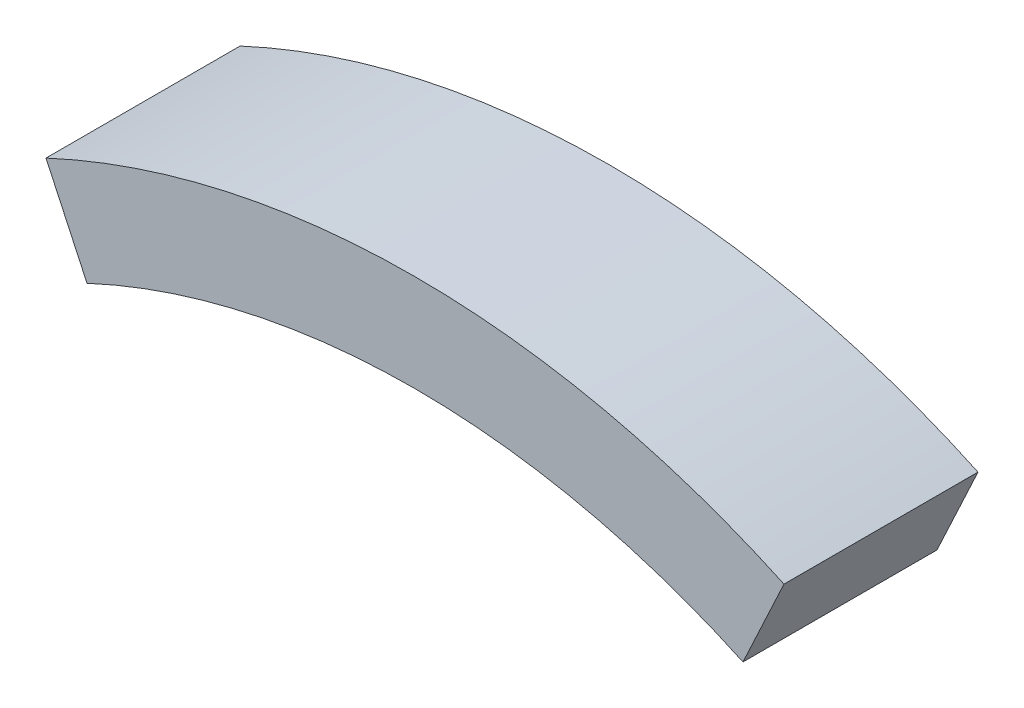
ISO-10303-21;
HEADER;
FILE_DESCRIPTION(('STEP AP214'),'2;1');
FILE_NAME('part.step','',(''),(''),'','','');
FILE_SCHEMA(('AUTOMOTIVE_DESIGN { 1 0 10303 214 1 1 1 1 }'));
ENDSEC;
DATA;
#1=APPLICATION_CONTEXT('core data for automotive mechanical design processes');
#2=APPLICATION_PROTOCOL_DEFINITION('international standard','automotive_design',2000,#1);
#3=PRODUCT_CONTEXT('',#1,'mechanical');
#4=PRODUCT('Part','Part','',(#3));
#5=PRODUCT_RELATED_PRODUCT_CATEGORY('part','',(#4));
#6=PRODUCT_DEFINITION_FORMATION('','',#4);
#7=PRODUCT_DEFINITION_CONTEXT('part definition',#1,'design');
#8=PRODUCT_DEFINITION('design','',#6,#7);
#9=PRODUCT_DEFINITION_SHAPE('','',#8);
#10=(LENGTH_UNIT() NAMED_UNIT(*) SI_UNIT(.MILLI.,.METRE.));
#11=(NAMED_UNIT(*) PLANE_ANGLE_UNIT() SI_UNIT($,.RADIAN.));
#12=(NAMED_UNIT(*) SI_UNIT($,.STERADIAN.) SOLID_ANGLE_UNIT());
#13=UNCERTAINTY_MEASURE_WITH_UNIT(LENGTH_MEASURE(1.E-05),#10,'distance_accuracy_value','');
#14=(GEOMETRIC_REPRESENTATION_CONTEXT(3) GLOBAL_UNCERTAINTY_ASSIGNED_CONTEXT((#13)) GLOBAL_UNIT_ASSIGNED_CONTEXT((#10,
#11,#12)) REPRESENTATION_CONTEXT('',''));
#15=CARTESIAN_POINT('',(0.,0.,0.));
#16=DIRECTION('',(0.,0.,1.));
#17=DIRECTION('',(1.,0.,0.));
#18=AXIS2_PLACEMENT_3D('',#15,#16,#17);
#19=CARTESIAN_POINT('',(0.,0.,10.));
#20=DIRECTION('',(0.,0.,-1.));
#21=DIRECTION('',(-0.999999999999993,0.,0.));
#22=AXIS2_PLACEMENT_3D('',#19,#20,#21);
#23=CYLINDRICAL_SURFACE('',#22,45.);
#24=CARTESIAN_POINT('',(0.,0.,0.));
#25=DIRECTION('',(0.,0.,1.));
#26=DIRECTION('',(0.999999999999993,0.,0.));
#27=AXIS2_PLACEMENT_3D('',#24,#25,#26);
#28=CIRCLE('',#27,45.);
#29=CARTESIAN_POINT('',(19.0178217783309,40.7838504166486,0.));
#30=VERTEX_POINT('',#29);
#31=CARTESIAN_POINT('',(-19.0178217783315,40.7838504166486,0.));
#32=VERTEX_POINT('',#31);
#33=EDGE_CURVE('E94',#30,#32,#28,.T.);
#34=ORIENTED_EDGE('',*,*,#33,.T.);
#35=DIRECTION('',(0.,0.,-1.));
#36=VECTOR('',#35,1.);
#37=CARTESIAN_POINT('',(-19.0178217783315,40.7838504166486,10.));
#38=LINE('',#37,#36);
#39=CARTESIAN_POINT('',(-19.0178217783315,40.7838504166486,10.));
#40=VERTEX_POINT('',#39);
#41=EDGE_CURVE('E11',#40,#32,#38,.T.);
#42=ORIENTED_EDGE('',*,*,#41,.F.);
#43=CARTESIAN_POINT('',(0.,0.,10.));
#44=DIRECTION('',(0.,0.,1.));
#45=DIRECTION('',(0.999999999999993,0.,0.));
#46=AXIS2_PLACEMENT_3D('',#43,#44,#45);
#47=CIRCLE('',#46,45.);
#48=CARTESIAN_POINT('',(19.0178217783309,40.7838504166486,10.));
#49=VERTEX_POINT('',#48);
#50=EDGE_CURVE('E82',#49,#40,#47,.T.);
#51=ORIENTED_EDGE('',*,*,#50,.F.);
#52=DIRECTION('',(0.,0.,-1.));
#53=VECTOR('',#52,1.);
#54=CARTESIAN_POINT('',(19.0178217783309,40.7838504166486,10.));
#55=LINE('',#54,#53);
#56=EDGE_CURVE('E90',#49,#30,#55,.T.);
#57=ORIENTED_EDGE('',*,*,#56,.T.);
#58=EDGE_LOOP('',(#34,#42,#51,#57));
#59=FACE_BOUND('',#58,.T.);
#60=ADVANCED_FACE('F31',(#59),#23,.T.);
#61=CARTESIAN_POINT('',(-19.0178217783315,40.7838504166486,10.));
#62=DIRECTION('',(0.906307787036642,0.422618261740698,0.));
#63=DIRECTION('',(-0.422618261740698,0.906307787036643,0.));
#64=AXIS2_PLACEMENT_3D('',#61,#62,#63);
#65=PLANE('',#64);
#66=DIRECTION('',(0.422618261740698,-0.906307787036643,0.));
#67=VECTOR('',#66,1.);
#68=CARTESIAN_POINT('',(-19.0178217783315,40.7838504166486,0.));
#69=LINE('',#68,#67);
#70=CARTESIAN_POINT('',(-16.904730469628,36.2523114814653,0.));
#71=VERTEX_POINT('',#70);
#72=EDGE_CURVE('E86',#32,#71,#69,.T.);
#73=ORIENTED_EDGE('',*,*,#72,.T.);
#74=DIRECTION('',(0.,0.,-1.));
#75=VECTOR('',#74,1.);
#76=CARTESIAN_POINT('',(-16.904730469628,36.2523114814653,10.));
#77=LINE('',#76,#75);
#78=CARTESIAN_POINT('',(-16.904730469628,36.2523114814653,10.));
#79=VERTEX_POINT('',#78);
#80=EDGE_CURVE('E39',#79,#71,#77,.T.);
#81=ORIENTED_EDGE('',*,*,#80,.F.);
#82=DIRECTION('',(0.422618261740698,-0.906307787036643,0.));
#83=VECTOR('',#82,1.);
#84=CARTESIAN_POINT('',(-19.0178217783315,40.7838504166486,10.));
#85=LINE('',#84,#83);
#86=EDGE_CURVE('E77',#40,#79,#85,.T.);
#87=ORIENTED_EDGE('',*,*,#86,.F.);
#88=ORIENTED_EDGE('',*,*,#41,.T.);
#89=EDGE_LOOP('',(#73,#81,#87,#88));
#90=FACE_BOUND('',#89,.T.);
#91=ADVANCED_FACE('F85',(#90),#65,.F.);
#92=CARTESIAN_POINT('',(0.,0.,10.));
#93=DIRECTION('',(0.,0.,-1.));
#94=DIRECTION('',(-0.999999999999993,0.,0.));
#95=AXIS2_PLACEMENT_3D('',#92,#93,#94);
#96=CYLINDRICAL_SURFACE('',#95,40.);
#97=CARTESIAN_POINT('',(0.,0.,0.));
#98=DIRECTION('',(0.,0.,-1.));
#99=DIRECTION('',(0.999999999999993,0.,0.));
#100=AXIS2_PLACEMENT_3D('',#97,#98,#99);
#101=CIRCLE('',#100,40.);
#102=CARTESIAN_POINT('',(16.9047304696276,36.2523114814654,0.));
#103=VERTEX_POINT('',#102);
#104=EDGE_CURVE('E64',#71,#103,#101,.T.);
#105=ORIENTED_EDGE('',*,*,#104,.T.);
#106=DIRECTION('',(0.,0.,-1.));
#107=VECTOR('',#106,1.);
#108=CARTESIAN_POINT('',(16.9047304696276,36.2523114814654,10.));
#109=LINE('',#108,#107);
#110=CARTESIAN_POINT('',(16.9047304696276,36.2523114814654,10.));
#111=VERTEX_POINT('',#110);
#112=EDGE_CURVE('E87',#111,#103,#109,.T.);
#113=ORIENTED_EDGE('',*,*,#112,.F.);
#114=CARTESIAN_POINT('',(0.,0.,10.));
#115=DIRECTION('',(0.,0.,-1.));
#116=DIRECTION('',(0.999999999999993,0.,0.));
#117=AXIS2_PLACEMENT_3D('',#114,#115,#116);
#118=CIRCLE('',#117,40.);
#119=EDGE_CURVE('E80',#79,#111,#118,.T.);
#120=ORIENTED_EDGE('',*,*,#119,.F.);
#121=ORIENTED_EDGE('',*,*,#80,.T.);
#122=EDGE_LOOP('',(#105,#113,#120,#121));
#123=FACE_BOUND('',#122,.T.);
#124=ADVANCED_FACE('F88',(#123),#96,.F.);
#125=CARTESIAN_POINT('',(19.0178217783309,40.7838504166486,10.));
#126=DIRECTION('',(-0.906307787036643,0.422618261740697,0.));
#127=DIRECTION('',(-0.422618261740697,-0.906307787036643,0.));
#128=AXIS2_PLACEMENT_3D('',#125,#126,#127);
#129=PLANE('',#128);
#130=DIRECTION('',(0.422618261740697,0.906307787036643,0.));
#131=VECTOR('',#130,1.);
#132=CARTESIAN_POINT('',(19.0178217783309,40.7838504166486,0.));
#133=LINE('',#132,#131);
#134=EDGE_CURVE('E70',#103,#30,#133,.T.);
#135=ORIENTED_EDGE('',*,*,#134,.T.);
#136=ORIENTED_EDGE('',*,*,#56,.F.);
#137=DIRECTION('',(0.422618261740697,0.906307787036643,0.));
#138=VECTOR('',#137,1.);
#139=CARTESIAN_POINT('',(19.0178217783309,40.7838504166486,10.));
#140=LINE('',#139,#138);
#141=EDGE_CURVE('E47',#111,#49,#140,.T.);
#142=ORIENTED_EDGE('',*,*,#141,.F.);
#143=ORIENTED_EDGE('',*,*,#112,.T.);
#144=EDGE_LOOP('',(#135,#136,#142,#143));
#145=FACE_BOUND('',#144,.T.);
#146=ADVANCED_FACE('F101',(#145),#129,.F.);
#147=CARTESIAN_POINT('',(0.,0.,10.));
#148=DIRECTION('',(0.,0.,1.));
#149=DIRECTION('',(0.999999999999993,0.,0.));
#150=AXIS2_PLACEMENT_3D('',#147,#148,#149);
#151=PLANE('',#150);
#152=ORIENTED_EDGE('',*,*,#50,.T.);
#153=ORIENTED_EDGE('',*,*,#86,.T.);
#154=ORIENTED_EDGE('',*,*,#119,.T.);
#155=ORIENTED_EDGE('',*,*,#141,.T.);
#156=EDGE_LOOP('',(#152,#153,#154,#155));
#157=FACE_BOUND('',#156,.T.);
#158=ADVANCED_FACE('F78',(#157),#151,.T.);
#159=CARTESIAN_POINT('',(0.,0.,0.));
#160=DIRECTION('',(0.,0.,1.));
#161=DIRECTION('',(0.999999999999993,0.,0.));
#162=AXIS2_PLACEMENT_3D('',#159,#160,#161);
#163=PLANE('',#162);
#164=ORIENTED_EDGE('',*,*,#33,.F.);
#165=ORIENTED_EDGE('',*,*,#134,.F.);
#166=ORIENTED_EDGE('',*,*,#104,.F.);
#167=ORIENTED_EDGE('',*,*,#72,.F.);
#168=EDGE_LOOP('',(#164,#165,#166,#167));
#169=FACE_BOUND('',#168,.T.);
#170=ADVANCED_FACE('F104',(#169),#163,.F.);
#171=CLOSED_SHELL('',(#60,#91,#124,#146,#158,#170));
#172=MANIFOLD_SOLID_BREP('B2',#171);
#173=ADVANCED_BREP_SHAPE_REPRESENTATION('',(#18,#172),#14);
#174=SHAPE_DEFINITION_REPRESENTATION(#9,#173);
ENDSEC;
END-ISO-10303-21;
